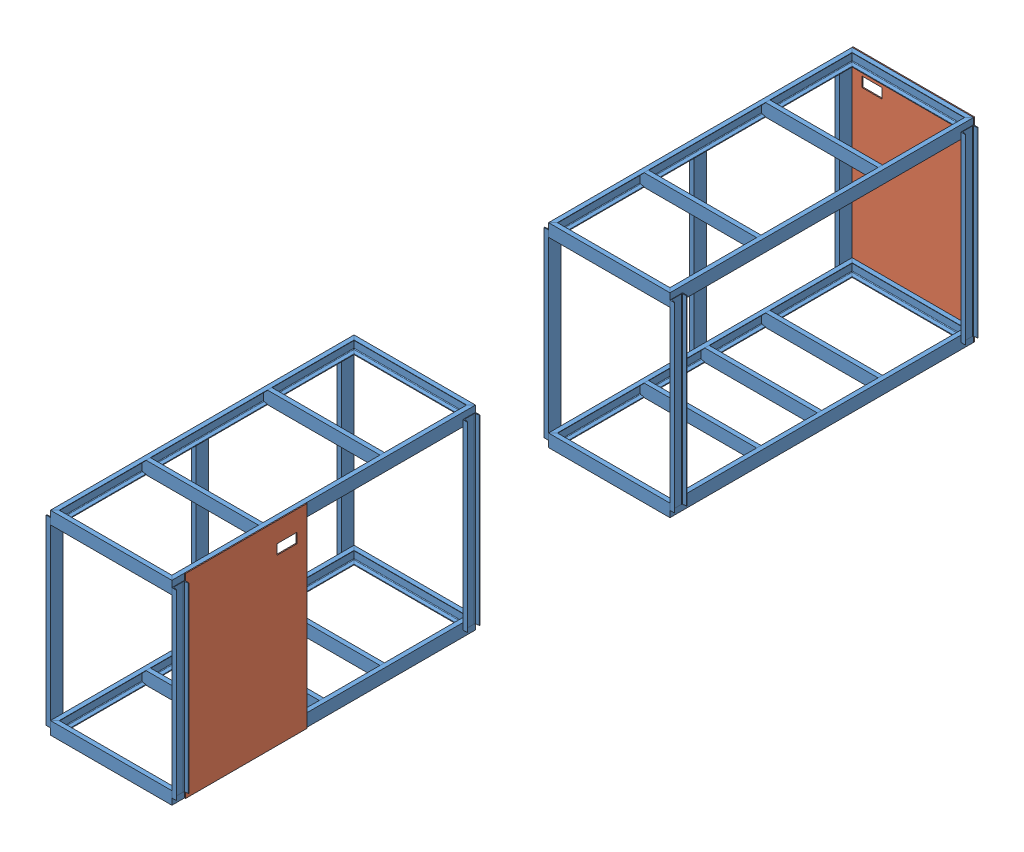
SolidWorks assembly Ducting.SLDASM, configuration Default (file format 13000). Lengths in mm.
Overall size (1308.1 1955.8 8058).
4 component instances, 2 part files, 12 mates.
Components (placement in the parent):
- Frame-1: Frame.SLDPRT [Default] at origin size (1308.1 1955.8 3048)
- Frame-4: Frame.SLDPRT [Default] at (0 0 -5000) size (1308.1 1955.8 3048)
- Rear Wall-1: Rear Wall.sldprt [Default] at (1219.2 -63.5 -127) x (0 0 -1) z (1 0 0) size (1220 1955.8 10)
- Rear Wall-2: Rear Wall.sldprt [Default] at (1219.2 -63.5 -8048) x (-1 0 0) z (0 0 -1) size (1220 1955.8 10)
Mates (geometry in assembly coordinates):
- Coincident7: coincident: plane of ? through (4000 1765.3 -5000) normal (-1 0 0); plane of ? through (4000 -63.5 -7921) normal (1 0 0)
- Coincident8: coincident: plane of ? through (3990 -63.5 -7921) normal (0 -1 0); plane of ? through (4000 -63.5 -8066.288) normal (0 -1 0)
- Coincident9: coincident: plane of ? through (4000 0 -6587.5) normal (0 0 -1); line of ? through (3990 -63.5 -6587.5) axis (0 1 0)
- Coincident10: coincident anti-aligned: plane of Frame-1 through (1219.2 0 -127) normal (0 0 -1); plane of Rear Wall-1 through (1229.2 -63.5 -127) normal (0 0 1)
- Coincident11: coincident aligned: plane of Frame-1 through (1174.75 -63.5 -3066.288) normal (0 -1 0); plane of Rear Wall-1 through (1229.2 -63.5 -127) normal (0 -1 0)
- Coincident12: coincident anti-aligned: plane of Frame-1 through (1219.2 -63.5 -3048) normal (1 0 0); plane of Rear Wall-1 through (1219.2 -63.5 -127) normal (-1 0 0)
- Coincident13: coincident anti-aligned: plane of Frame-4 through (0 1765.3 -5000) normal (-1 0 0); plane of ? through (0 -63.5 -6460.5) normal (1 0 0)
- Coincident14: coincident aligned: plane of Frame-4 through (0 1892.3 -4981.712) normal (0 1 0); plane of ? through (-10 1892.3 -6460.5) normal (0 1 0)
- Coincident15: coincident anti-aligned: plane of Frame-4 through (-44.45 0 -6460.5) normal (0 0 1); plane of ? through (-10 1892.3 -6460.5) normal (0 0 -1)
- Coincident16: coincident anti-aligned: plane of Frame-4 through (0 1765.3 -8048) normal (0 0 -1); plane of Rear Wall-2 through (1219.2 -63.5 -8048) normal (0 0 1)
- Coincident17: coincident aligned: plane of Frame-4 through (1219.2 1765.3 -8048) normal (1 0 0); plane of Rear Wall-2 through (1219.2 -63.5 -8058) normal (1 0 0)
- Coincident18: coincident aligned: plane of Frame-4 through (-7.3152 1892.3 -8003.55) normal (0 1 0); plane of Rear Wall-2 through (1219.2 1892.3 -8058) normal (0 1 0)
